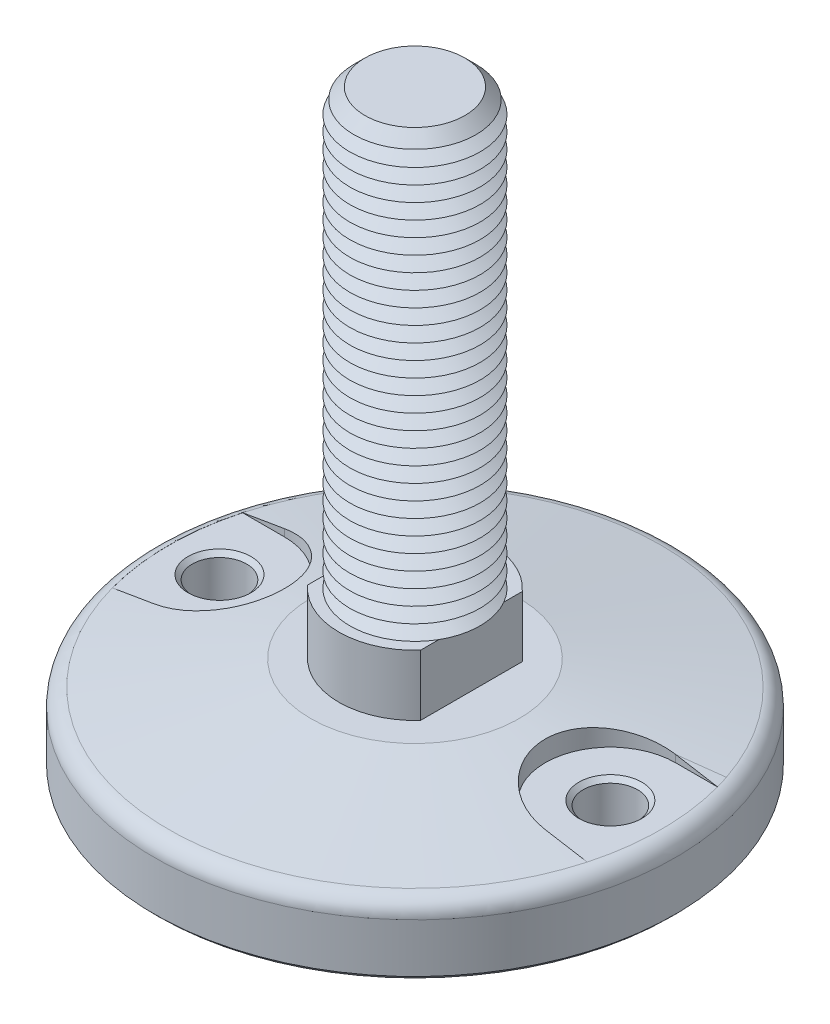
from build123d import *

# Parameters (mm, degrees)
FILLET1_R                = 4
SKETCH3_R                = 17.5
BOSS_EXTRUDE1_DEPTH      = 14
CUT_EXTRUDE1_START       = -14
CUT_EXTRUDE1_DEPTH       = 14
SKETCH5_R                = 15
BOSS_EXTRUDE2_DEPTH      = 100
CHAMFER1_SIZE            = 3.5
LPATTERN1_COUNT          = 28
LPATTERN1_PITCH          = 3.5
CUT_EXTRUDE4_DEPTH       = 5.79
SKETCH10_R               = 6.25
CUT_EXTRUDE5_DEPTH       = 16.21
CHAMFER2_SIZE            = 1
CHAMFER2_OF_MIRROR1_SIZE = 1
CHAMFER3_SIZE            = 1


with BuildPart() as part:
    # Sketch2 → Revolve1 (revolve)
    with BuildSketch(Plane(origin=(0, 0, 0), x_dir=(0, 0, -1), z_dir=(1, 0, 0))):
        Polygon((0, 0), (-24, 0), (-60, -6.347771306), (-60, -22), (0, -22), align=None)
    revolve(axis=Axis((0, 61.338865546, 0), (0, -1, 0)))

    # Fillet1
    fillet1_edges = [part.edges().sort_by_distance(p)[0] for p in [
        (0, -6.347771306, -60),
    ]]
    fillet(fillet1_edges, radius=FILLET1_R)

    # Sketch3 → Boss-Extrude1 (add)
    with BuildSketch(Plane(origin=(0, 0, 0), x_dir=(1, 0, 0), z_dir=(0, 1, 0))):
        with Locations(Location((0, 0, 0), (0, 0, 270))):
            Circle(SKETCH3_R)
    extrude(amount=BOSS_EXTRUDE1_DEPTH)

    # Sketch4 → Cut-Extrude1 (cut)
    with BuildSketch(Plane(origin=(0, 14, 0), x_dir=(1, 0, 0), z_dir=(0, 1, 0)).offset(CUT_EXTRUDE1_START)):
        with BuildLine():
            Line((-13, 11.715374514), (-13, -11.715374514))
            ThreePointArc((-13, -11.715374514), (-17.5, 0), (-13, 11.715374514))
        make_face()
        with BuildLine():
            Line((13, -11.715374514), (13, 11.715374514))
            ThreePointArc((13, 11.715374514), (17.5, 0), (13, -11.715374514))
        make_face()
    extrude(amount=CUT_EXTRUDE1_DEPTH, mode=Mode.SUBTRACT)

    # Sketch5 → Boss-Extrude2 (add)
    with BuildSketch(Plane(origin=(0, 14, 0), x_dir=(1, 0, 0), z_dir=(0, 1, 0))):
        with Locations(Location((0, 0, 0), (0, 0, 29.926434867))):
            Circle(SKETCH5_R)
    extrude(amount=BOSS_EXTRUDE2_DEPTH)

    # Chamfer1
    chamfer1_edges = [part.edges().sort_by_distance(p)[0] for p in [
        (-13, 114, 7.483314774),
    ]]
    chamfer(chamfer1_edges, length=CHAMFER1_SIZE)

    # Sketch6 → Cut-Revolve1 (revolve, cut)
    with BuildSketch(Plane(origin=(0, 0, 0), x_dir=(0, 0, -1), z_dir=(1, 0, 0)), mode=Mode.PRIVATE) as cut_revolve1_sk:
        Polygon((-15, 14), (-11.968911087, 15.75), (-15, 17.5), align=None)
    cut_revolve1 = revolve(cut_revolve1_sk.sketch.rotate(Axis((0, 61.338865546, 0), (0, -1, 0)), 240.073565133), axis=Axis((0, 61.338865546, 0), (0, -1, 0)), mode=Mode.SUBTRACT)

    # LPattern1: Cut-Revolve1 ×28
    with Locations(*[(0, i * LPATTERN1_PITCH, 0) for i in range(1, LPATTERN1_COUNT)]):
        add(cut_revolve1, mode=Mode.SUBTRACT)

    # Sketch8 → Cut-Extrude4 (cut)
    with BuildSketch(Plane(origin=(0, 0, 0), x_dir=(1, 0, 0), z_dir=(0, 1, 0))):
        with BuildLine():
            Line((-45, 15), (-54.674279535, 15))
            ThreePointArc((-54.674279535, 15), (-56.694592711, 0), (-54.674279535, -15))
            Line((-54.674279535, -15), (-45, -15))
            ThreePointArc((-45, -15), (-30, 0), (-45, 15))
        make_face()
    cut_extrude4 = extrude(amount=-CUT_EXTRUDE4_DEPTH, mode=Mode.SUBTRACT)

    # Sketch10 → Cut-Extrude5 (cut)
    with BuildSketch(Plane(origin=(0, -5.79, 0), x_dir=(1, 0, 0), z_dir=(0, 1, 0))):
        with Locations(Location((-45, 0, 0), (0, 0, 270))):
            Circle(SKETCH10_R)
    cut_extrude5 = extrude(amount=-CUT_EXTRUDE5_DEPTH, mode=Mode.SUBTRACT)

    # Chamfer2
    chamfer2_edges = [part.edges().sort_by_distance(p)[0] for p in [
        (-45, -5.79, -6.25),
        (-45, -22, -6.25),
    ]]
    chamfer(chamfer2_edges, length=CHAMFER2_SIZE)

    # Mirror1: Cut-Extrude4, Cut-Extrude5 across plane
    add(cut_extrude4.mirror(Plane(origin=(0, 0, 0), x_dir=(0, 0, 1), z_dir=(1, 0, 0))), mode=Mode.SUBTRACT)
    add(cut_extrude5.mirror(Plane(origin=(0, 0, 0), x_dir=(0, 0, 1), z_dir=(1, 0, 0))), mode=Mode.SUBTRACT)

    # Chamfer2 of Mirror1
    chamfer2_of_mirror1_edges = [part.edges().sort_by_distance(p)[0] for p in [
        (45, -5.79, -6.25),
        (45, -22, -6.25),
    ]]
    chamfer(chamfer2_of_mirror1_edges, length=CHAMFER2_OF_MIRROR1_SIZE)

    # Chamfer3
    chamfer3_edges = [part.edges().sort_by_distance(p)[0] for p in [
        (0, -22, -60),
    ]]
    chamfer(chamfer3_edges, length=CHAMFER3_SIZE)


solid = part.part
